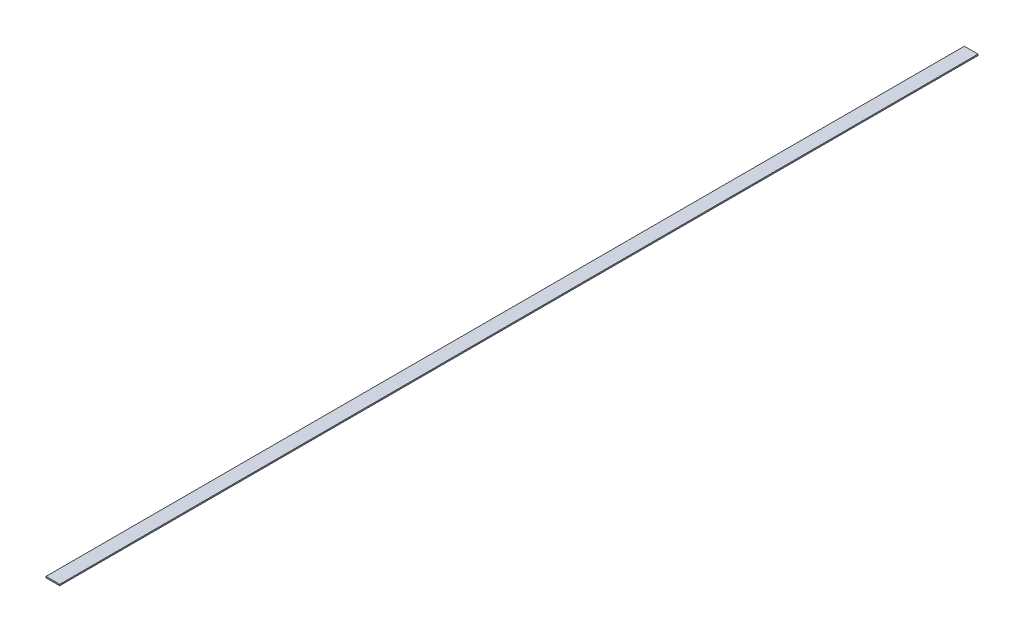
from build123d import *

# Parameters (mm, degrees)
SKETCH1_W           = 50.8
SKETCH1_H           = 3403.6
BOSS_EXTRUDE1_DEPTH = 4.7625


with BuildPart() as part:
    # Sketch1 → Boss-Extrude1 (new body)
    with BuildSketch(Plane.XZ.offset(-24.646602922)):
        with Locations((-19.015232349, 1701.8)):
            Rectangle(SKETCH1_W, SKETCH1_H)
    extrude(amount=-BOSS_EXTRUDE1_DEPTH)


solid = part.part
